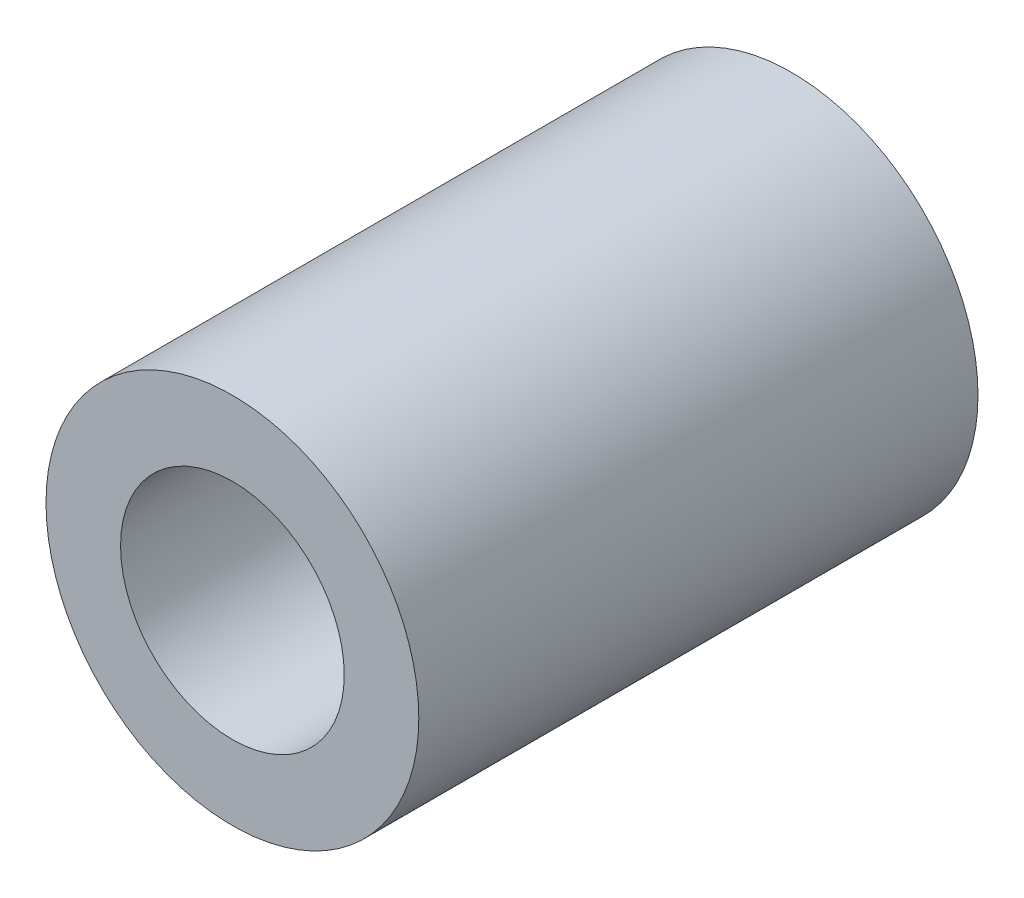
from build123d import *

# Parameters (mm, degrees)
ESQUISSE1_R      = 10
ESQUISSE1_R_2    = 6
EXTRUSION1_DEPTH = 30


with BuildPart() as part:
    # Esquisse1 → Extrusion1 (new body)
    with BuildSketch(Plane.XY):
        Circle(ESQUISSE1_R)
        Circle(ESQUISSE1_R_2, mode=Mode.SUBTRACT)
    extrude(amount=EXTRUSION1_DEPTH)


solid = part.part
